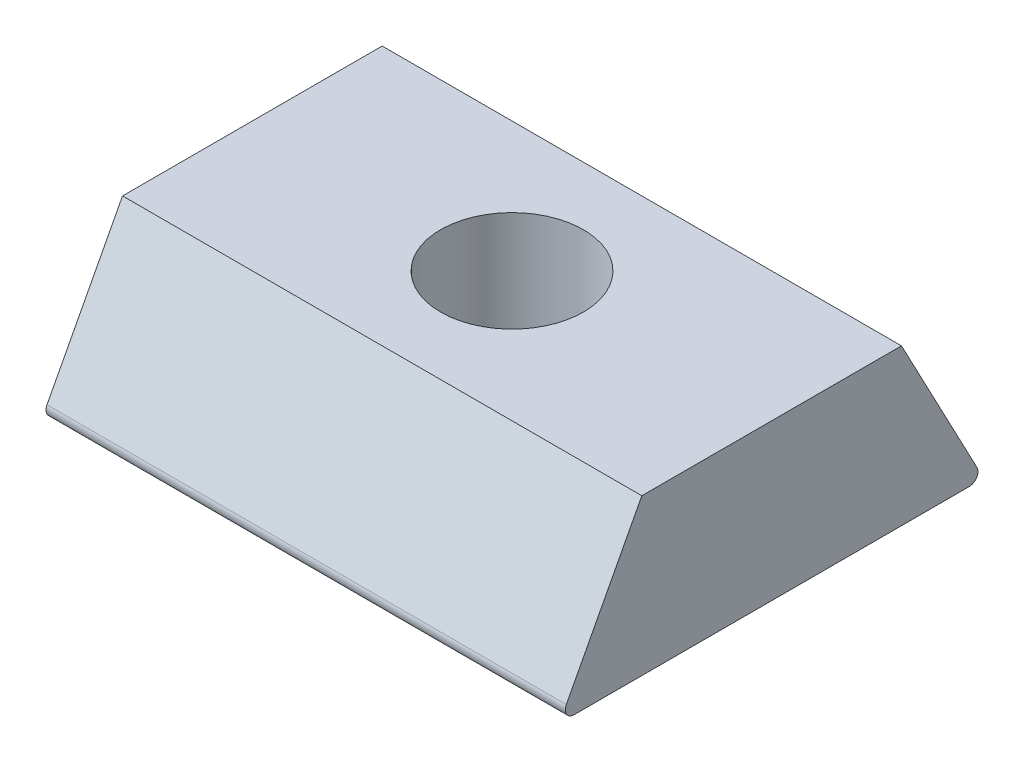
ISO-10303-21;
HEADER;
FILE_DESCRIPTION(('STEP AP214'),'2;1');
FILE_NAME('part.step','',(''),(''),'','','');
FILE_SCHEMA(('AUTOMOTIVE_DESIGN { 1 0 10303 214 1 1 1 1 }'));
ENDSEC;
DATA;
#1=APPLICATION_CONTEXT('core data for automotive mechanical design processes');
#2=APPLICATION_PROTOCOL_DEFINITION('international standard','automotive_design',2000,#1);
#3=PRODUCT_CONTEXT('',#1,'mechanical');
#4=PRODUCT('Part','Part','',(#3));
#5=PRODUCT_RELATED_PRODUCT_CATEGORY('part','',(#4));
#6=PRODUCT_DEFINITION_FORMATION('','',#4);
#7=PRODUCT_DEFINITION_CONTEXT('part definition',#1,'design');
#8=PRODUCT_DEFINITION('design','',#6,#7);
#9=PRODUCT_DEFINITION_SHAPE('','',#8);
#10=(LENGTH_UNIT() NAMED_UNIT(*) SI_UNIT(.MILLI.,.METRE.));
#11=(NAMED_UNIT(*) PLANE_ANGLE_UNIT() SI_UNIT($,.RADIAN.));
#12=(NAMED_UNIT(*) SI_UNIT($,.STERADIAN.) SOLID_ANGLE_UNIT());
#13=UNCERTAINTY_MEASURE_WITH_UNIT(LENGTH_MEASURE(1.E-05),#10,'distance_accuracy_value','');
#14=(GEOMETRIC_REPRESENTATION_CONTEXT(3) GLOBAL_UNCERTAINTY_ASSIGNED_CONTEXT((#13)) GLOBAL_UNIT_ASSIGNED_CONTEXT((#10,
#11,#12)) REPRESENTATION_CONTEXT('',''));
#15=CARTESIAN_POINT('',(0.,0.,0.));
#16=DIRECTION('',(0.,0.,1.));
#17=DIRECTION('',(1.,0.,0.));
#18=AXIS2_PLACEMENT_3D('',#15,#16,#17);
#19=CARTESIAN_POINT('',(6.,3.6,-4.9));
#20=DIRECTION('',(-1.,0.,0.));
#21=DIRECTION('',(0.,0.,1.));
#22=AXIS2_PLACEMENT_3D('',#19,#20,#21);
#23=PLANE('',#22);
#24=DIRECTION('',(0.,0.,-1.));
#25=VECTOR('',#24,1.);
#26=CARTESIAN_POINT('',(6.,0.,-4.9));
#27=LINE('',#26,#25);
#28=CARTESIAN_POINT('',(6.,0.,4.56829852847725));
#29=VERTEX_POINT('',#28);
#30=CARTESIAN_POINT('',(6.,0.,-4.56829852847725));
#31=VERTEX_POINT('',#30);
#32=EDGE_CURVE('E120',#29,#31,#27,.T.);
#33=ORIENTED_EDGE('',*,*,#32,.T.);
#34=CARTESIAN_POINT('',(6.,0.2,-4.56829852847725));
#35=DIRECTION('',(-1.,0.,0.));
#36=DIRECTION('',(0.,0.,1.));
#37=AXIS2_PLACEMENT_3D('',#34,#35,#36);
#38=CIRCLE('',#37,0.2);
#39=CARTESIAN_POINT('',(6.,0.293351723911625,-4.74517547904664));
#40=VERTEX_POINT('',#39);
#41=EDGE_CURVE('E48',#31,#40,#38,.F.);
#42=ORIENTED_EDGE('',*,*,#41,.T.);
#43=DIRECTION('',(0.,0.88438475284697,0.466758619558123));
#44=VECTOR('',#43,1.);
#45=CARTESIAN_POINT('',(6.,2.8156910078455,-3.41394085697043));
#46=LINE('',#45,#44);
#47=CARTESIAN_POINT('',(6.,3.6,-3.));
#48=VERTEX_POINT('',#47);
#49=EDGE_CURVE('E102',#40,#48,#46,.T.);
#50=ORIENTED_EDGE('',*,*,#49,.T.);
#51=DIRECTION('',(0.,0.,-1.));
#52=VECTOR('',#51,1.);
#53=CARTESIAN_POINT('',(6.,3.6,-4.9));
#54=LINE('',#53,#52);
#55=CARTESIAN_POINT('',(6.,3.6,3.));
#56=VERTEX_POINT('',#55);
#57=EDGE_CURVE('E107',#56,#48,#54,.T.);
#58=ORIENTED_EDGE('',*,*,#57,.F.);
#59=DIRECTION('',(0.,0.884384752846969,-0.466758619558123));
#60=VECTOR('',#59,1.);
#61=CARTESIAN_POINT('',(6.,0.,4.9));
#62=LINE('',#61,#60);
#63=CARTESIAN_POINT('',(6.,0.293351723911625,4.74517547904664));
#64=VERTEX_POINT('',#63);
#65=EDGE_CURVE('E95',#64,#56,#62,.T.);
#66=ORIENTED_EDGE('',*,*,#65,.F.);
#67=CARTESIAN_POINT('',(6.,0.2,4.56829852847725));
#68=DIRECTION('',(-1.,0.,0.));
#69=DIRECTION('',(0.,0.,1.));
#70=AXIS2_PLACEMENT_3D('',#67,#68,#69);
#71=CIRCLE('',#70,0.2);
#72=EDGE_CURVE('E55',#64,#29,#71,.F.);
#73=ORIENTED_EDGE('',*,*,#72,.T.);
#74=EDGE_LOOP('',(#33,#42,#50,#58,#66,#73));
#75=FACE_BOUND('',#74,.T.);
#76=ADVANCED_FACE('F40',(#75),#23,.F.);
#77=CARTESIAN_POINT('',(-6.,3.6,-4.9));
#78=DIRECTION('',(1.,0.,0.));
#79=DIRECTION('',(0.,0.,-1.));
#80=AXIS2_PLACEMENT_3D('',#77,#78,#79);
#81=PLANE('',#80);
#82=DIRECTION('',(0.,-0.88438475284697,-0.466758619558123));
#83=VECTOR('',#82,1.);
#84=CARTESIAN_POINT('',(-6.,2.8156910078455,-3.41394085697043));
#85=LINE('',#84,#83);
#86=CARTESIAN_POINT('',(-6.,3.6,-3.));
#87=VERTEX_POINT('',#86);
#88=CARTESIAN_POINT('',(-6.,0.293351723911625,-4.74517547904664));
#89=VERTEX_POINT('',#88);
#90=EDGE_CURVE('E142',#87,#89,#85,.T.);
#91=ORIENTED_EDGE('',*,*,#90,.T.);
#92=CARTESIAN_POINT('',(-6.,0.2,-4.56829852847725));
#93=DIRECTION('',(1.,0.,0.));
#94=DIRECTION('',(0.,0.,-1.));
#95=AXIS2_PLACEMENT_3D('',#92,#93,#94);
#96=CIRCLE('',#95,0.2);
#97=CARTESIAN_POINT('',(-6.,0.,-4.56829852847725));
#98=VERTEX_POINT('',#97);
#99=EDGE_CURVE('E129',#89,#98,#96,.F.);
#100=ORIENTED_EDGE('',*,*,#99,.T.);
#101=DIRECTION('',(0.,0.,1.));
#102=VECTOR('',#101,1.);
#103=CARTESIAN_POINT('',(-6.,0.,-4.9));
#104=LINE('',#103,#102);
#105=CARTESIAN_POINT('',(-6.,0.,4.56829852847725));
#106=VERTEX_POINT('',#105);
#107=EDGE_CURVE('E115',#98,#106,#104,.T.);
#108=ORIENTED_EDGE('',*,*,#107,.T.);
#109=CARTESIAN_POINT('',(-6.,0.2,4.56829852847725));
#110=DIRECTION('',(1.,0.,0.));
#111=DIRECTION('',(0.,0.,-1.));
#112=AXIS2_PLACEMENT_3D('',#109,#110,#111);
#113=CIRCLE('',#112,0.2);
#114=CARTESIAN_POINT('',(-6.,0.293351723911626,4.74517547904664));
#115=VERTEX_POINT('',#114);
#116=EDGE_CURVE('E127',#106,#115,#113,.F.);
#117=ORIENTED_EDGE('',*,*,#116,.T.);
#118=DIRECTION('',(0.,-0.88438475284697,0.466758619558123));
#119=VECTOR('',#118,1.);
#120=CARTESIAN_POINT('',(-6.,6.86107423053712,1.27887748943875));
#121=LINE('',#120,#119);
#122=CARTESIAN_POINT('',(-6.,3.6,3.));
#123=VERTEX_POINT('',#122);
#124=EDGE_CURVE('E112',#123,#115,#121,.T.);
#125=ORIENTED_EDGE('',*,*,#124,.F.);
#126=DIRECTION('',(0.,0.,1.));
#127=VECTOR('',#126,1.);
#128=CARTESIAN_POINT('',(-6.,3.6,-4.9));
#129=LINE('',#128,#127);
#130=EDGE_CURVE('E110',#87,#123,#129,.T.);
#131=ORIENTED_EDGE('',*,*,#130,.F.);
#132=EDGE_LOOP('',(#91,#100,#108,#117,#125,#131));
#133=FACE_BOUND('',#132,.T.);
#134=ADVANCED_FACE('F146',(#133),#81,.F.);
#135=CARTESIAN_POINT('',(0.,3.6,0.));
#136=DIRECTION('',(0.,1.,0.));
#137=DIRECTION('',(0.,0.,1.));
#138=AXIS2_PLACEMENT_3D('',#135,#136,#137);
#139=PLANE('',#138);
#140=CARTESIAN_POINT('',(0.,3.6,0.));
#141=DIRECTION('',(0.,1.,0.));
#142=DIRECTION('',(0.,0.,1.));
#143=AXIS2_PLACEMENT_3D('',#140,#141,#142);
#144=CIRCLE('',#143,1.64999999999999);
#145=CARTESIAN_POINT('',(0.,3.6,1.64999999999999));
#146=VERTEX_POINT('',#145);
#147=EDGE_CURVE('E155',#146,#146,#144,.T.);
#148=ORIENTED_EDGE('',*,*,#147,.F.);
#149=EDGE_LOOP('',(#148));
#150=FACE_BOUND('',#149,.T.);
#151=DIRECTION('',(-1.,0.,0.));
#152=VECTOR('',#151,1.);
#153=CARTESIAN_POINT('',(25.8824671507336,3.6,-3.));
#154=LINE('',#153,#152);
#155=EDGE_CURVE('E141',#48,#87,#154,.T.);
#156=ORIENTED_EDGE('',*,*,#155,.T.);
#157=ORIENTED_EDGE('',*,*,#130,.T.);
#158=DIRECTION('',(-1.,0.,0.));
#159=VECTOR('',#158,1.);
#160=CARTESIAN_POINT('',(6.,3.6,3.));
#161=LINE('',#160,#159);
#162=EDGE_CURVE('E99',#56,#123,#161,.T.);
#163=ORIENTED_EDGE('',*,*,#162,.F.);
#164=ORIENTED_EDGE('',*,*,#57,.T.);
#165=EDGE_LOOP('',(#156,#157,#163,#164));
#166=FACE_BOUND('',#165,.T.);
#167=ADVANCED_FACE('F106',(#150,#166),#139,.T.);
#168=CARTESIAN_POINT('',(0.,0.,0.));
#169=DIRECTION('',(0.,1.,0.));
#170=DIRECTION('',(0.,0.,1.));
#171=AXIS2_PLACEMENT_3D('',#168,#169,#170);
#172=PLANE('',#171);
#173=CARTESIAN_POINT('',(0.,0.,0.));
#174=DIRECTION('',(0.,1.,0.));
#175=DIRECTION('',(0.,0.,1.));
#176=AXIS2_PLACEMENT_3D('',#173,#174,#175);
#177=CIRCLE('',#176,1.65);
#178=CARTESIAN_POINT('',(0.,0.,1.65));
#179=VERTEX_POINT('',#178);
#180=EDGE_CURVE('E150',#179,#179,#177,.T.);
#181=ORIENTED_EDGE('',*,*,#180,.T.);
#182=EDGE_LOOP('',(#181));
#183=FACE_BOUND('',#182,.T.);
#184=ORIENTED_EDGE('',*,*,#107,.F.);
#185=DIRECTION('',(-1.,0.,0.));
#186=VECTOR('',#185,1.);
#187=CARTESIAN_POINT('',(0.,0.,-4.56829852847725));
#188=LINE('',#187,#186);
#189=EDGE_CURVE('E62',#98,#31,#188,.F.);
#190=ORIENTED_EDGE('',*,*,#189,.T.);
#191=ORIENTED_EDGE('',*,*,#32,.F.);
#192=DIRECTION('',(1.,0.,0.));
#193=VECTOR('',#192,1.);
#194=CARTESIAN_POINT('',(-6.,0.,4.56829852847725));
#195=LINE('',#194,#193);
#196=EDGE_CURVE('E131',#29,#106,#195,.F.);
#197=ORIENTED_EDGE('',*,*,#196,.T.);
#198=EDGE_LOOP('',(#184,#190,#191,#197));
#199=FACE_BOUND('',#198,.T.);
#200=ADVANCED_FACE('F148',(#183,#199),#172,.F.);
#201=CARTESIAN_POINT('',(6.,0.,4.9));
#202=DIRECTION('',(0.,0.466758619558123,0.88438475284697));
#203=DIRECTION('',(0.,-0.88438475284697,0.466758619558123));
#204=AXIS2_PLACEMENT_3D('',#201,#202,#203);
#205=PLANE('',#204);
#206=ORIENTED_EDGE('',*,*,#124,.T.);
#207=DIRECTION('',(1.,0.,0.));
#208=VECTOR('',#207,1.);
#209=CARTESIAN_POINT('',(6.,0.293351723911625,4.74517547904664));
#210=LINE('',#209,#208);
#211=EDGE_CURVE('E11',#115,#64,#210,.T.);
#212=ORIENTED_EDGE('',*,*,#211,.T.);
#213=ORIENTED_EDGE('',*,*,#65,.T.);
#214=ORIENTED_EDGE('',*,*,#162,.T.);
#215=EDGE_LOOP('',(#206,#212,#213,#214));
#216=FACE_BOUND('',#215,.T.);
#217=ADVANCED_FACE('F98',(#216),#205,.T.);
#218=CARTESIAN_POINT('',(25.8824671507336,0.,-4.9));
#219=DIRECTION('',(0.,-0.466758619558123,0.88438475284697));
#220=DIRECTION('',(0.,-0.88438475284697,-0.466758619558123));
#221=AXIS2_PLACEMENT_3D('',#218,#219,#220);
#222=PLANE('',#221);
#223=ORIENTED_EDGE('',*,*,#49,.F.);
#224=DIRECTION('',(-1.,0.,0.));
#225=VECTOR('',#224,1.);
#226=CARTESIAN_POINT('',(25.8824671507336,0.293351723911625,-4.74517547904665));
#227=LINE('',#226,#225);
#228=EDGE_CURVE('E117',#40,#89,#227,.T.);
#229=ORIENTED_EDGE('',*,*,#228,.T.);
#230=ORIENTED_EDGE('',*,*,#90,.F.);
#231=ORIENTED_EDGE('',*,*,#155,.F.);
#232=EDGE_LOOP('',(#223,#229,#230,#231));
#233=FACE_BOUND('',#232,.T.);
#234=ADVANCED_FACE('F138',(#233),#222,.F.);
#235=CARTESIAN_POINT('',(0.,3.6,0.));
#236=DIRECTION('',(0.,1.,0.));
#237=DIRECTION('',(0.,0.,1.));
#238=AXIS2_PLACEMENT_3D('',#235,#236,#237);
#239=CYLINDRICAL_SURFACE('',#238,1.64999999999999);
#240=ORIENTED_EDGE('',*,*,#180,.F.);
#241=EDGE_LOOP('',(#240));
#242=FACE_BOUND('',#241,.T.);
#243=ORIENTED_EDGE('',*,*,#147,.T.);
#244=EDGE_LOOP('',(#243));
#245=FACE_BOUND('',#244,.T.);
#246=ADVANCED_FACE('F159',(#242,#245),#239,.F.);
#247=CARTESIAN_POINT('',(25.8824671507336,0.2,-4.56829852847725));
#248=DIRECTION('',(-1.,0.,0.));
#249=DIRECTION('',(0.,0.,1.));
#250=AXIS2_PLACEMENT_3D('',#247,#248,#249);
#251=CYLINDRICAL_SURFACE('',#250,0.2);
#252=ORIENTED_EDGE('',*,*,#41,.F.);
#253=ORIENTED_EDGE('',*,*,#189,.F.);
#254=ORIENTED_EDGE('',*,*,#99,.F.);
#255=ORIENTED_EDGE('',*,*,#228,.F.);
#256=EDGE_LOOP('',(#252,#253,#254,#255));
#257=FACE_BOUND('',#256,.T.);
#258=ADVANCED_FACE('F144',(#257),#251,.T.);
#259=CARTESIAN_POINT('',(6.,0.2,4.56829852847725));
#260=DIRECTION('',(-1.,0.,0.));
#261=DIRECTION('',(0.,0.,1.));
#262=AXIS2_PLACEMENT_3D('',#259,#260,#261);
#263=CYLINDRICAL_SURFACE('',#262,0.2);
#264=ORIENTED_EDGE('',*,*,#116,.F.);
#265=ORIENTED_EDGE('',*,*,#196,.F.);
#266=ORIENTED_EDGE('',*,*,#72,.F.);
#267=ORIENTED_EDGE('',*,*,#211,.F.);
#268=EDGE_LOOP('',(#264,#265,#266,#267));
#269=FACE_BOUND('',#268,.T.);
#270=ADVANCED_FACE('F42',(#269),#263,.T.);
#271=CLOSED_SHELL('',(#76,#134,#167,#200,#217,#234,#246,#258,#270));
#272=MANIFOLD_SOLID_BREP('B2',#271);
#273=ADVANCED_BREP_SHAPE_REPRESENTATION('',(#18,#272),#14);
#274=SHAPE_DEFINITION_REPRESENTATION(#9,#273);
ENDSEC;
END-ISO-10303-21;
